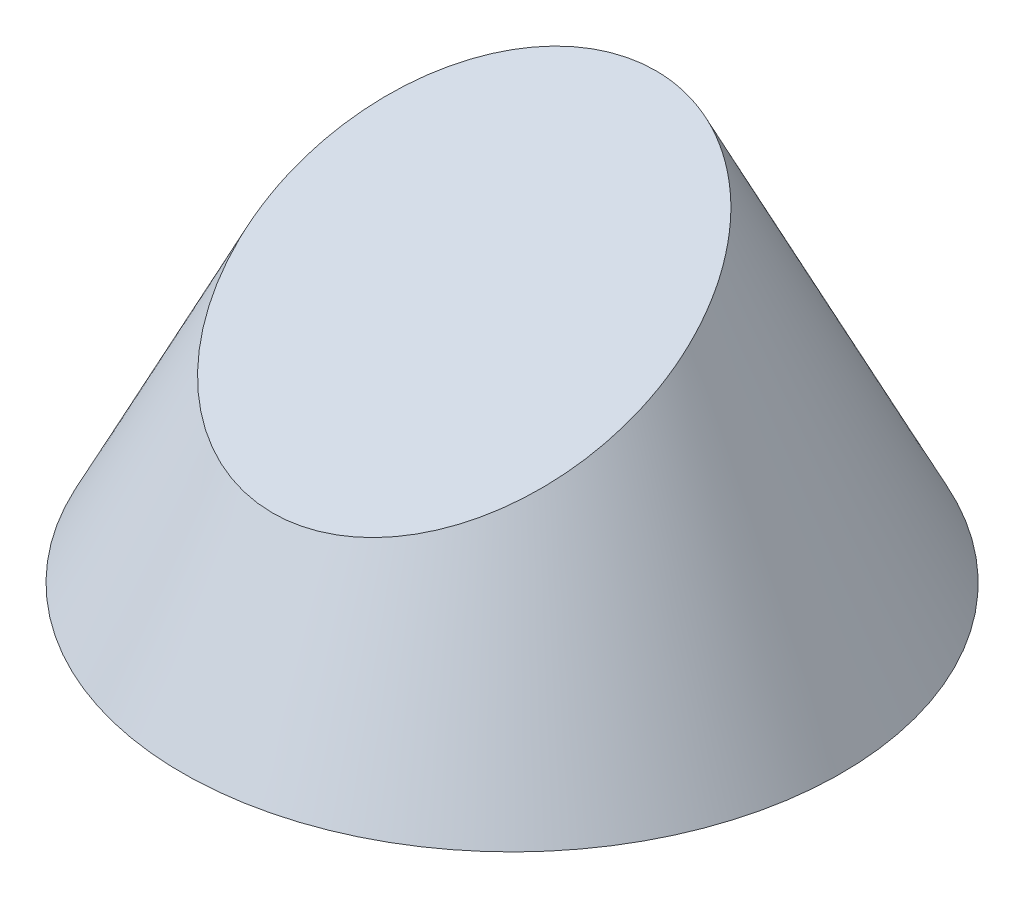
ISO-10303-21;
HEADER;
FILE_DESCRIPTION(('STEP AP214'),'2;1');
FILE_NAME('part.step','',(''),(''),'','','');
FILE_SCHEMA(('AUTOMOTIVE_DESIGN { 1 0 10303 214 1 1 1 1 }'));
ENDSEC;
DATA;
#1=APPLICATION_CONTEXT('core data for automotive mechanical design processes');
#2=APPLICATION_PROTOCOL_DEFINITION('international standard','automotive_design',2000,#1);
#3=PRODUCT_CONTEXT('',#1,'mechanical');
#4=PRODUCT('Part','Part','',(#3));
#5=PRODUCT_RELATED_PRODUCT_CATEGORY('part','',(#4));
#6=PRODUCT_DEFINITION_FORMATION('','',#4);
#7=PRODUCT_DEFINITION_CONTEXT('part definition',#1,'design');
#8=PRODUCT_DEFINITION('design','',#6,#7);
#9=PRODUCT_DEFINITION_SHAPE('','',#8);
#10=(LENGTH_UNIT() NAMED_UNIT(*) SI_UNIT(.MILLI.,.METRE.));
#11=(NAMED_UNIT(*) PLANE_ANGLE_UNIT() SI_UNIT($,.RADIAN.));
#12=(NAMED_UNIT(*) SI_UNIT($,.STERADIAN.) SOLID_ANGLE_UNIT());
#13=UNCERTAINTY_MEASURE_WITH_UNIT(LENGTH_MEASURE(1.E-05),#10,'distance_accuracy_value','');
#14=(GEOMETRIC_REPRESENTATION_CONTEXT(3) GLOBAL_UNCERTAINTY_ASSIGNED_CONTEXT((#13)) GLOBAL_UNIT_ASSIGNED_CONTEXT((#10,
#11,#12)) REPRESENTATION_CONTEXT('',''));
#15=CARTESIAN_POINT('',(0.,0.,0.));
#16=DIRECTION('',(0.,0.,1.));
#17=DIRECTION('',(1.,0.,0.));
#18=AXIS2_PLACEMENT_3D('',#15,#16,#17);
#19=CARTESIAN_POINT('',(0.,0.,0.));
#20=DIRECTION('',(0.,-1.,0.));
#21=DIRECTION('',(0.,0.,-1.));
#22=AXIS2_PLACEMENT_3D('',#19,#20,#21);
#23=PLANE('',#22);
#24=CARTESIAN_POINT('',(0.,0.,0.));
#25=DIRECTION('',(0.,-1.,0.));
#26=DIRECTION('',(0.,0.,-1.));
#27=AXIS2_PLACEMENT_3D('',#24,#25,#26);
#28=CIRCLE('',#27,20.);
#29=CARTESIAN_POINT('',(0.,0.,-20.));
#30=VERTEX_POINT('',#29);
#31=EDGE_CURVE('E48',#30,#30,#28,.T.);
#32=ORIENTED_EDGE('',*,*,#31,.T.);
#33=EDGE_LOOP('',(#32));
#34=FACE_BOUND('',#33,.T.);
#35=ADVANCED_FACE('F41',(#34),#23,.T.);
#36=CARTESIAN_POINT('',(0.,0.,0.));
#37=DIRECTION('',(0.,-1.,0.));
#38=DIRECTION('',(0.,0.,-1.));
#39=AXIS2_PLACEMENT_3D('',#36,#37,#38);
#40=CONICAL_SURFACE('',#39,20.,0.463647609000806);
#41=CARTESIAN_POINT('',(0.,16.7483119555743,2.90646100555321));
#42=DIRECTION('',(0.,-0.894427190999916,-0.447213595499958));
#43=DIRECTION('',(0.,-0.447213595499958,0.894427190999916));
#44=AXIS2_PLACEMENT_3D('',#41,#42,#43);
#45=ELLIPSE('',#44,12.9980887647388,11.2566750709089);
#46=CARTESIAN_POINT('',(0.,10.9353899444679,14.5323050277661));
#47=VERTEX_POINT('',#46);
#48=EDGE_CURVE('E10',#47,#47,#45,.F.);
#49=ORIENTED_EDGE('',*,*,#48,.F.);
#50=EDGE_LOOP('',(#49));
#51=FACE_BOUND('',#50,.T.);
#52=ORIENTED_EDGE('',*,*,#31,.F.);
#53=EDGE_LOOP('',(#52));
#54=FACE_BOUND('',#53,.T.);
#55=ADVANCED_FACE('F56',(#51,#54),#40,.T.);
#56=CARTESIAN_POINT('',(-20.,10.9353899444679,14.5323050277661));
#57=DIRECTION('',(0.,-0.894427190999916,-0.447213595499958));
#58=DIRECTION('',(0.,0.447213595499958,-0.894427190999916));
#59=AXIS2_PLACEMENT_3D('',#56,#57,#58);
#60=PLANE('',#59);
#61=ORIENTED_EDGE('',*,*,#48,.T.);
#62=EDGE_LOOP('',(#61));
#63=FACE_BOUND('',#62,.T.);
#64=ADVANCED_FACE('F58',(#63),#60,.F.);
#65=CLOSED_SHELL('',(#35,#55,#64));
#66=MANIFOLD_SOLID_BREP('B2',#65);
#67=ADVANCED_BREP_SHAPE_REPRESENTATION('',(#18,#66),#14);
#68=SHAPE_DEFINITION_REPRESENTATION(#9,#67);
ENDSEC;
END-ISO-10303-21;
